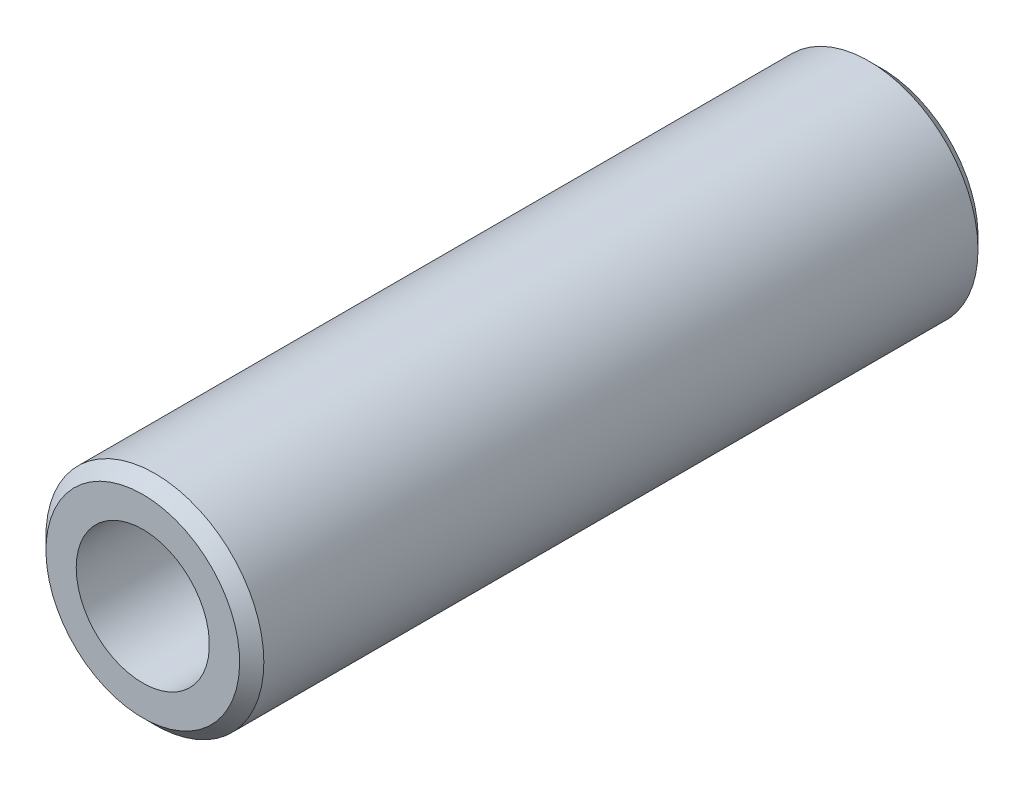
ISO-10303-21;
HEADER;
FILE_DESCRIPTION(('STEP AP214'),'2;1');
FILE_NAME('part.step','',(''),(''),'','','');
FILE_SCHEMA(('AUTOMOTIVE_DESIGN { 1 0 10303 214 1 1 1 1 }'));
ENDSEC;
DATA;
#1=APPLICATION_CONTEXT('core data for automotive mechanical design processes');
#2=APPLICATION_PROTOCOL_DEFINITION('international standard','automotive_design',2000,#1);
#3=PRODUCT_CONTEXT('',#1,'mechanical');
#4=PRODUCT('Part','Part','',(#3));
#5=PRODUCT_RELATED_PRODUCT_CATEGORY('part','',(#4));
#6=PRODUCT_DEFINITION_FORMATION('','',#4);
#7=PRODUCT_DEFINITION_CONTEXT('part definition',#1,'design');
#8=PRODUCT_DEFINITION('design','',#6,#7);
#9=PRODUCT_DEFINITION_SHAPE('','',#8);
#10=(LENGTH_UNIT() NAMED_UNIT(*) SI_UNIT(.MILLI.,.METRE.));
#11=(NAMED_UNIT(*) PLANE_ANGLE_UNIT() SI_UNIT($,.RADIAN.));
#12=(NAMED_UNIT(*) SI_UNIT($,.STERADIAN.) SOLID_ANGLE_UNIT());
#13=UNCERTAINTY_MEASURE_WITH_UNIT(LENGTH_MEASURE(1.E-05),#10,'distance_accuracy_value','');
#14=(GEOMETRIC_REPRESENTATION_CONTEXT(3) GLOBAL_UNCERTAINTY_ASSIGNED_CONTEXT((#13)) GLOBAL_UNIT_ASSIGNED_CONTEXT((#10,
#11,#12)) REPRESENTATION_CONTEXT('',''));
#15=CARTESIAN_POINT('',(0.,0.,0.));
#16=DIRECTION('',(0.,0.,1.));
#17=DIRECTION('',(1.,0.,0.));
#18=AXIS2_PLACEMENT_3D('',#15,#16,#17);
#19=CARTESIAN_POINT('',(8.09599999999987,-8.09599999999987,-30.4999999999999));
#20=DIRECTION('',(0.,0.,-1.));
#21=DIRECTION('',(-1.,0.,0.));
#22=AXIS2_PLACEMENT_3D('',#19,#20,#21);
#23=PLANE('',#22);
#24=CARTESIAN_POINT('',(0.,0.,-30.4999999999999));
#25=DIRECTION('',(0.,0.,-1.));
#26=DIRECTION('',(-1.,0.,0.));
#27=AXIS2_PLACEMENT_3D('',#24,#25,#26);
#28=CIRCLE('',#27,5.5000000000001);
#29=CARTESIAN_POINT('',(-5.5000000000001,0.,-30.4999999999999));
#30=VERTEX_POINT('',#29);
#31=EDGE_CURVE('E19',#30,#30,#28,.T.);
#32=ORIENTED_EDGE('',*,*,#31,.F.);
#33=EDGE_LOOP('',(#32));
#34=FACE_BOUND('',#33,.T.);
#35=CARTESIAN_POINT('',(0.,0.,-30.4999999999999));
#36=DIRECTION('',(0.,0.,1.));
#37=DIRECTION('',(0.,-1.,0.));
#38=AXIS2_PLACEMENT_3D('',#35,#36,#37);
#39=CIRCLE('',#38,8.00000000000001);
#40=CARTESIAN_POINT('',(0.,-8.00000000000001,-30.4999999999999));
#41=VERTEX_POINT('',#40);
#42=EDGE_CURVE('E34',#41,#41,#39,.T.);
#43=ORIENTED_EDGE('',*,*,#42,.F.);
#44=EDGE_LOOP('',(#43));
#45=FACE_BOUND('',#44,.T.);
#46=ADVANCED_FACE('F15',(#34,#45),#23,.T.);
#47=CARTESIAN_POINT('',(0.,0.,30.4999999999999));
#48=DIRECTION('',(0.,0.,-1.));
#49=DIRECTION('',(-1.,0.,0.));
#50=AXIS2_PLACEMENT_3D('',#47,#48,#49);
#51=CYLINDRICAL_SURFACE('',#50,5.5000000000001);
#52=ORIENTED_EDGE('',*,*,#31,.T.);
#53=EDGE_LOOP('',(#52));
#54=FACE_BOUND('',#53,.T.);
#55=CARTESIAN_POINT('',(0.,0.,30.4999999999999));
#56=DIRECTION('',(0.,0.,-1.));
#57=DIRECTION('',(-1.,0.,0.));
#58=AXIS2_PLACEMENT_3D('',#55,#56,#57);
#59=CIRCLE('',#58,5.5000000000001);
#60=CARTESIAN_POINT('',(-5.5000000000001,0.,30.4999999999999));
#61=VERTEX_POINT('',#60);
#62=EDGE_CURVE('E32',#61,#61,#59,.T.);
#63=ORIENTED_EDGE('',*,*,#62,.F.);
#64=EDGE_LOOP('',(#63));
#65=FACE_BOUND('',#64,.T.);
#66=ADVANCED_FACE('F41',(#54,#65),#51,.F.);
#67=CARTESIAN_POINT('',(0.,0.,-29.4));
#68=DIRECTION('',(0.,0.,1.));
#69=DIRECTION('',(0.,-1.,0.));
#70=AXIS2_PLACEMENT_3D('',#67,#68,#69);
#71=CONICAL_SURFACE('',#70,9.09999999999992,0.785398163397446);
#72=CARTESIAN_POINT('',(0.,0.,-29.4999999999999));
#73=DIRECTION('',(0.,0.,1.));
#74=DIRECTION('',(1.,0.,0.));
#75=AXIS2_PLACEMENT_3D('',#72,#73,#74);
#76=CIRCLE('',#75,9.00000000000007);
#77=CARTESIAN_POINT('',(9.00000000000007,0.,-29.4999999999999));
#78=VERTEX_POINT('',#77);
#79=EDGE_CURVE('E28',#78,#78,#76,.T.);
#80=ORIENTED_EDGE('',*,*,#79,.F.);
#81=EDGE_LOOP('',(#80));
#82=FACE_BOUND('',#81,.T.);
#83=ORIENTED_EDGE('',*,*,#42,.T.);
#84=EDGE_LOOP('',(#83));
#85=FACE_BOUND('',#84,.T.);
#86=ADVANCED_FACE('F52',(#82,#85),#71,.T.);
#87=CARTESIAN_POINT('',(-8.09599999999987,-8.09599999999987,30.4999999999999));
#88=DIRECTION('',(0.,0.,1.));
#89=DIRECTION('',(1.,0.,0.));
#90=AXIS2_PLACEMENT_3D('',#87,#88,#89);
#91=PLANE('',#90);
#92=ORIENTED_EDGE('',*,*,#62,.T.);
#93=EDGE_LOOP('',(#92));
#94=FACE_BOUND('',#93,.T.);
#95=CARTESIAN_POINT('',(0.,0.,30.4999999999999));
#96=DIRECTION('',(0.,0.,-1.));
#97=DIRECTION('',(0.,1.,0.));
#98=AXIS2_PLACEMENT_3D('',#95,#96,#97);
#99=CIRCLE('',#98,8.00000000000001);
#100=CARTESIAN_POINT('',(0.,8.00000000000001,30.4999999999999));
#101=VERTEX_POINT('',#100);
#102=EDGE_CURVE('E23',#101,#101,#99,.T.);
#103=ORIENTED_EDGE('',*,*,#102,.F.);
#104=EDGE_LOOP('',(#103));
#105=FACE_BOUND('',#104,.T.);
#106=ADVANCED_FACE('F61',(#94,#105),#91,.T.);
#107=CARTESIAN_POINT('',(0.,0.,29.5000000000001));
#108=DIRECTION('',(0.,0.,-1.));
#109=DIRECTION('',(-1.,0.,0.));
#110=AXIS2_PLACEMENT_3D('',#107,#108,#109);
#111=CYLINDRICAL_SURFACE('',#110,9.00000000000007);
#112=ORIENTED_EDGE('',*,*,#79,.T.);
#113=EDGE_LOOP('',(#112));
#114=FACE_BOUND('',#113,.T.);
#115=CARTESIAN_POINT('',(0.,0.,29.5));
#116=DIRECTION('',(0.,0.,1.));
#117=DIRECTION('',(1.,0.,0.));
#118=AXIS2_PLACEMENT_3D('',#115,#116,#117);
#119=CIRCLE('',#118,8.99999999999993);
#120=CARTESIAN_POINT('',(8.99999999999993,0.,29.5));
#121=VERTEX_POINT('',#120);
#122=EDGE_CURVE('E10',#121,#121,#119,.T.);
#123=ORIENTED_EDGE('',*,*,#122,.F.);
#124=EDGE_LOOP('',(#123));
#125=FACE_BOUND('',#124,.T.);
#126=ADVANCED_FACE('F55',(#114,#125),#111,.T.);
#127=CARTESIAN_POINT('',(0.,0.,29.4));
#128=DIRECTION('',(0.,0.,-1.));
#129=DIRECTION('',(0.,1.,0.));
#130=AXIS2_PLACEMENT_3D('',#127,#128,#129);
#131=CONICAL_SURFACE('',#130,9.09999999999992,0.785398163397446);
#132=ORIENTED_EDGE('',*,*,#102,.T.);
#133=EDGE_LOOP('',(#132));
#134=FACE_BOUND('',#133,.T.);
#135=ORIENTED_EDGE('',*,*,#122,.T.);
#136=EDGE_LOOP('',(#135));
#137=FACE_BOUND('',#136,.T.);
#138=ADVANCED_FACE('F17',(#134,#137),#131,.T.);
#139=CLOSED_SHELL('',(#46,#66,#86,#106,#126,#138));
#140=MANIFOLD_SOLID_BREP('B1',#139);
#141=ADVANCED_BREP_SHAPE_REPRESENTATION('',(#18,#140),#14);
#142=SHAPE_DEFINITION_REPRESENTATION(#9,#141);
ENDSEC;
END-ISO-10303-21;
